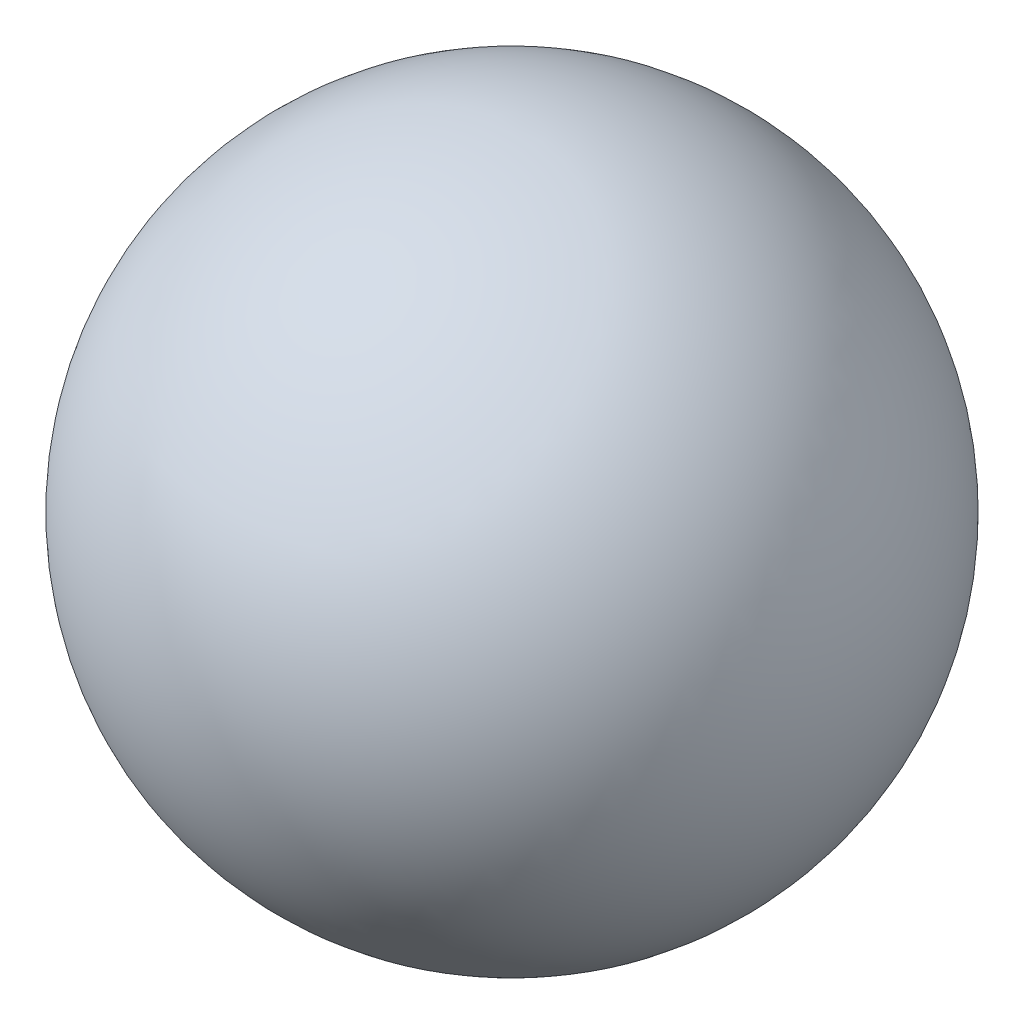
ISO-10303-21;
HEADER;
FILE_DESCRIPTION(('STEP AP214'),'2;1');
FILE_NAME('part.step','',(''),(''),'','','');
FILE_SCHEMA(('AUTOMOTIVE_DESIGN { 1 0 10303 214 1 1 1 1 }'));
ENDSEC;
DATA;
#1=APPLICATION_CONTEXT('core data for automotive mechanical design processes');
#2=APPLICATION_PROTOCOL_DEFINITION('international standard','automotive_design',2000,#1);
#3=PRODUCT_CONTEXT('',#1,'mechanical');
#4=PRODUCT('Part','Part','',(#3));
#5=PRODUCT_RELATED_PRODUCT_CATEGORY('part','',(#4));
#6=PRODUCT_DEFINITION_FORMATION('','',#4);
#7=PRODUCT_DEFINITION_CONTEXT('part definition',#1,'design');
#8=PRODUCT_DEFINITION('design','',#6,#7);
#9=PRODUCT_DEFINITION_SHAPE('','',#8);
#10=(LENGTH_UNIT() NAMED_UNIT(*) SI_UNIT(.MILLI.,.METRE.));
#11=(NAMED_UNIT(*) PLANE_ANGLE_UNIT() SI_UNIT($,.RADIAN.));
#12=(NAMED_UNIT(*) SI_UNIT($,.STERADIAN.) SOLID_ANGLE_UNIT());
#13=UNCERTAINTY_MEASURE_WITH_UNIT(LENGTH_MEASURE(1.E-05),#10,'distance_accuracy_value','');
#14=(GEOMETRIC_REPRESENTATION_CONTEXT(3) GLOBAL_UNCERTAINTY_ASSIGNED_CONTEXT((#13)) GLOBAL_UNIT_ASSIGNED_CONTEXT((#10,
#11,#12)) REPRESENTATION_CONTEXT('',''));
#15=CARTESIAN_POINT('',(0.,0.,0.));
#16=DIRECTION('',(0.,0.,1.));
#17=DIRECTION('',(1.,0.,0.));
#18=AXIS2_PLACEMENT_3D('',#15,#16,#17);
#19=CARTESIAN_POINT('',(0.,0.,0.));
#20=DIRECTION('',(0.,-1.,0.));
#21=DIRECTION('',(-1.,0.,0.));
#22=AXIS2_PLACEMENT_3D('',#19,#20,#21);
#23=SPHERICAL_SURFACE('',#22,254.);
#24=CARTESIAN_POINT('',(0.,-254.,0.));
#25=VERTEX_POINT('',#24);
#26=VERTEX_LOOP('',#25);
#27=FACE_BOUND('',#26,.T.);
#28=ADVANCED_FACE('F32',(#27),#23,.T.);
#29=CLOSED_SHELL('',(#28));
#30=MANIFOLD_SOLID_BREP('B2',#29);
#31=ADVANCED_BREP_SHAPE_REPRESENTATION('',(#18,#30),#14);
#32=SHAPE_DEFINITION_REPRESENTATION(#9,#31);
ENDSEC;
END-ISO-10303-21;
